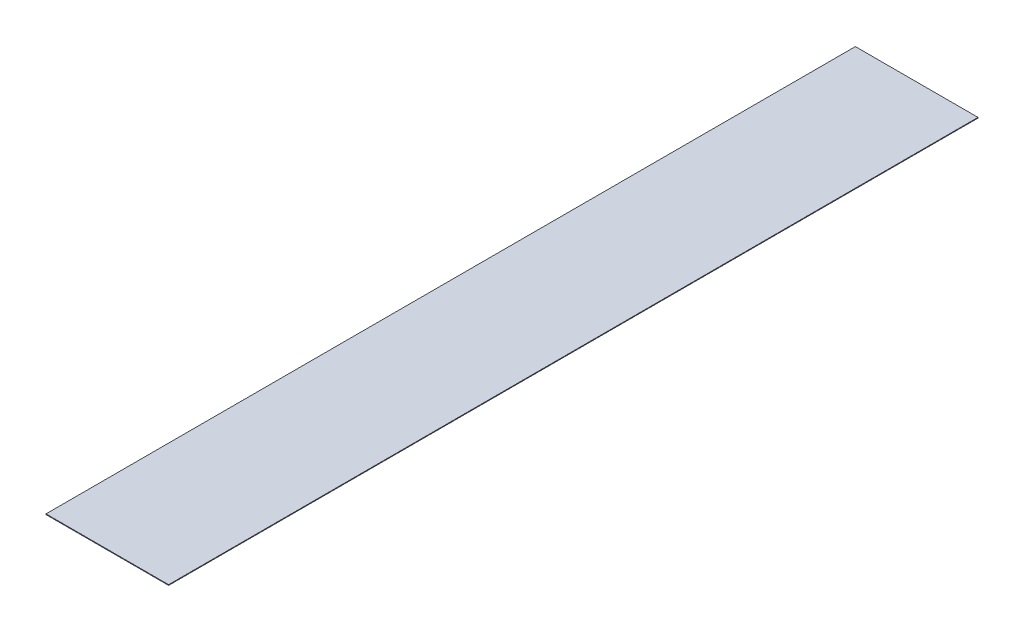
ISO-10303-21;
HEADER;
FILE_DESCRIPTION(('STEP AP214'),'2;1');
FILE_NAME('part.step','',(''),(''),'','','');
FILE_SCHEMA(('AUTOMOTIVE_DESIGN { 1 0 10303 214 1 1 1 1 }'));
ENDSEC;
DATA;
#1=APPLICATION_CONTEXT('core data for automotive mechanical design processes');
#2=APPLICATION_PROTOCOL_DEFINITION('international standard','automotive_design',2000,#1);
#3=PRODUCT_CONTEXT('',#1,'mechanical');
#4=PRODUCT('Part','Part','',(#3));
#5=PRODUCT_RELATED_PRODUCT_CATEGORY('part','',(#4));
#6=PRODUCT_DEFINITION_FORMATION('','',#4);
#7=PRODUCT_DEFINITION_CONTEXT('part definition',#1,'design');
#8=PRODUCT_DEFINITION('design','',#6,#7);
#9=PRODUCT_DEFINITION_SHAPE('','',#8);
#10=(LENGTH_UNIT() NAMED_UNIT(*) SI_UNIT(.MILLI.,.METRE.));
#11=(NAMED_UNIT(*) PLANE_ANGLE_UNIT() SI_UNIT($,.RADIAN.));
#12=(NAMED_UNIT(*) SI_UNIT($,.STERADIAN.) SOLID_ANGLE_UNIT());
#13=UNCERTAINTY_MEASURE_WITH_UNIT(LENGTH_MEASURE(1.E-05),#10,'distance_accuracy_value','');
#14=(GEOMETRIC_REPRESENTATION_CONTEXT(3) GLOBAL_UNCERTAINTY_ASSIGNED_CONTEXT((#13)) GLOBAL_UNIT_ASSIGNED_CONTEXT((#10,
#11,#12)) REPRESENTATION_CONTEXT('',''));
#15=CARTESIAN_POINT('',(0.,0.,0.));
#16=DIRECTION('',(0.,0.,1.));
#17=DIRECTION('',(1.,0.,0.));
#18=AXIS2_PLACEMENT_3D('',#15,#16,#17);
#19=CARTESIAN_POINT('',(0.,0.254,76.2));
#20=DIRECTION('',(0.,0.,-1.));
#21=DIRECTION('',(-1.,0.,0.));
#22=AXIS2_PLACEMENT_3D('',#19,#20,#21);
#23=PLANE('',#22);
#24=DIRECTION('',(1.,0.,0.));
#25=VECTOR('',#24,1.);
#26=CARTESIAN_POINT('',(0.,0.,76.2));
#27=LINE('',#26,#25);
#28=CARTESIAN_POINT('',(19.05,0.,76.2));
#29=VERTEX_POINT('',#28);
#30=CARTESIAN_POINT('',(66.675,0.,76.2));
#31=VERTEX_POINT('',#30);
#32=EDGE_CURVE('E98',#29,#31,#27,.T.);
#33=ORIENTED_EDGE('',*,*,#32,.T.);
#34=DIRECTION('',(0.,-1.,0.));
#35=VECTOR('',#34,1.);
#36=CARTESIAN_POINT('',(66.675,0.254,76.2));
#37=LINE('',#36,#35);
#38=CARTESIAN_POINT('',(66.675,0.254,76.2));
#39=VERTEX_POINT('',#38);
#40=EDGE_CURVE('E11',#39,#31,#37,.T.);
#41=ORIENTED_EDGE('',*,*,#40,.F.);
#42=DIRECTION('',(1.,0.,0.));
#43=VECTOR('',#42,1.);
#44=CARTESIAN_POINT('',(0.,0.254,76.2));
#45=LINE('',#44,#43);
#46=CARTESIAN_POINT('',(19.05,0.254,76.2));
#47=VERTEX_POINT('',#46);
#48=EDGE_CURVE('E84',#47,#39,#45,.T.);
#49=ORIENTED_EDGE('',*,*,#48,.F.);
#50=DIRECTION('',(0.,-1.,0.));
#51=VECTOR('',#50,1.);
#52=CARTESIAN_POINT('',(19.05,0.254,76.2));
#53=LINE('',#52,#51);
#54=EDGE_CURVE('E51',#47,#29,#53,.T.);
#55=ORIENTED_EDGE('',*,*,#54,.T.);
#56=EDGE_LOOP('',(#33,#41,#49,#55));
#57=FACE_BOUND('',#56,.T.);
#58=ADVANCED_FACE('F35',(#57),#23,.F.);
#59=CARTESIAN_POINT('',(66.675,0.254,0.));
#60=DIRECTION('',(-1.,0.,0.));
#61=DIRECTION('',(0.,0.,1.));
#62=AXIS2_PLACEMENT_3D('',#59,#60,#61);
#63=PLANE('',#62);
#64=DIRECTION('',(0.,0.,-1.));
#65=VECTOR('',#64,1.);
#66=CARTESIAN_POINT('',(66.675,0.,0.));
#67=LINE('',#66,#65);
#68=CARTESIAN_POINT('',(66.675,0.,-238.125));
#69=VERTEX_POINT('',#68);
#70=EDGE_CURVE('E89',#31,#69,#67,.T.);
#71=ORIENTED_EDGE('',*,*,#70,.T.);
#72=DIRECTION('',(0.,-1.,0.));
#73=VECTOR('',#72,1.);
#74=CARTESIAN_POINT('',(66.675,0.254,-238.125));
#75=LINE('',#74,#73);
#76=CARTESIAN_POINT('',(66.675,0.254,-238.125));
#77=VERTEX_POINT('',#76);
#78=EDGE_CURVE('E43',#77,#69,#75,.T.);
#79=ORIENTED_EDGE('',*,*,#78,.F.);
#80=DIRECTION('',(0.,0.,-1.));
#81=VECTOR('',#80,1.);
#82=CARTESIAN_POINT('',(66.675,0.254,0.));
#83=LINE('',#82,#81);
#84=EDGE_CURVE('E76',#39,#77,#83,.T.);
#85=ORIENTED_EDGE('',*,*,#84,.F.);
#86=ORIENTED_EDGE('',*,*,#40,.T.);
#87=EDGE_LOOP('',(#71,#79,#85,#86));
#88=FACE_BOUND('',#87,.T.);
#89=ADVANCED_FACE('F88',(#88),#63,.F.);
#90=CARTESIAN_POINT('',(0.,0.254,-238.125));
#91=DIRECTION('',(0.,0.,-1.));
#92=DIRECTION('',(-1.,0.,0.));
#93=AXIS2_PLACEMENT_3D('',#90,#91,#92);
#94=PLANE('',#93);
#95=DIRECTION('',(1.,0.,0.));
#96=VECTOR('',#95,1.);
#97=CARTESIAN_POINT('',(0.,0.,-238.125));
#98=LINE('',#97,#96);
#99=CARTESIAN_POINT('',(19.05,0.,-238.125));
#100=VERTEX_POINT('',#99);
#101=EDGE_CURVE('E101',#100,#69,#98,.T.);
#102=ORIENTED_EDGE('',*,*,#101,.F.);
#103=DIRECTION('',(0.,-1.,0.));
#104=VECTOR('',#103,1.);
#105=CARTESIAN_POINT('',(19.05,0.254,-238.125));
#106=LINE('',#105,#104);
#107=CARTESIAN_POINT('',(19.05,0.254,-238.125));
#108=VERTEX_POINT('',#107);
#109=EDGE_CURVE('E65',#108,#100,#106,.T.);
#110=ORIENTED_EDGE('',*,*,#109,.F.);
#111=DIRECTION('',(1.,0.,0.));
#112=VECTOR('',#111,1.);
#113=CARTESIAN_POINT('',(0.,0.254,-238.125));
#114=LINE('',#113,#112);
#115=EDGE_CURVE('E83',#108,#77,#114,.T.);
#116=ORIENTED_EDGE('',*,*,#115,.T.);
#117=ORIENTED_EDGE('',*,*,#78,.T.);
#118=EDGE_LOOP('',(#102,#110,#116,#117));
#119=FACE_BOUND('',#118,.T.);
#120=ADVANCED_FACE('F92',(#119),#94,.T.);
#121=CARTESIAN_POINT('',(19.05,0.254,0.));
#122=DIRECTION('',(-1.,0.,0.));
#123=DIRECTION('',(0.,0.,1.));
#124=AXIS2_PLACEMENT_3D('',#121,#122,#123);
#125=PLANE('',#124);
#126=DIRECTION('',(0.,0.,-1.));
#127=VECTOR('',#126,1.);
#128=CARTESIAN_POINT('',(19.05,0.,0.));
#129=LINE('',#128,#127);
#130=EDGE_CURVE('E103',#29,#100,#129,.T.);
#131=ORIENTED_EDGE('',*,*,#130,.F.);
#132=ORIENTED_EDGE('',*,*,#54,.F.);
#133=DIRECTION('',(0.,0.,-1.));
#134=VECTOR('',#133,1.);
#135=CARTESIAN_POINT('',(19.05,0.254,0.));
#136=LINE('',#135,#134);
#137=EDGE_CURVE('E93',#47,#108,#136,.T.);
#138=ORIENTED_EDGE('',*,*,#137,.T.);
#139=ORIENTED_EDGE('',*,*,#109,.T.);
#140=EDGE_LOOP('',(#131,#132,#138,#139));
#141=FACE_BOUND('',#140,.T.);
#142=ADVANCED_FACE('F109',(#141),#125,.T.);
#143=CARTESIAN_POINT('',(0.,0.254,0.));
#144=DIRECTION('',(0.,1.,0.));
#145=DIRECTION('',(0.,0.,1.));
#146=AXIS2_PLACEMENT_3D('',#143,#144,#145);
#147=PLANE('',#146);
#148=ORIENTED_EDGE('',*,*,#48,.T.);
#149=ORIENTED_EDGE('',*,*,#84,.T.);
#150=ORIENTED_EDGE('',*,*,#115,.F.);
#151=ORIENTED_EDGE('',*,*,#137,.F.);
#152=EDGE_LOOP('',(#148,#149,#150,#151));
#153=FACE_BOUND('',#152,.T.);
#154=ADVANCED_FACE('F80',(#153),#147,.T.);
#155=CARTESIAN_POINT('',(0.,0.,0.));
#156=DIRECTION('',(0.,1.,0.));
#157=DIRECTION('',(0.,0.,1.));
#158=AXIS2_PLACEMENT_3D('',#155,#156,#157);
#159=PLANE('',#158);
#160=ORIENTED_EDGE('',*,*,#32,.F.);
#161=ORIENTED_EDGE('',*,*,#130,.T.);
#162=ORIENTED_EDGE('',*,*,#101,.T.);
#163=ORIENTED_EDGE('',*,*,#70,.F.);
#164=EDGE_LOOP('',(#160,#161,#162,#163));
#165=FACE_BOUND('',#164,.T.);
#166=ADVANCED_FACE('F108',(#165),#159,.F.);
#167=CLOSED_SHELL('',(#58,#89,#120,#142,#154,#166));
#168=MANIFOLD_SOLID_BREP('B2',#167);
#169=ADVANCED_BREP_SHAPE_REPRESENTATION('',(#18,#168),#14);
#170=SHAPE_DEFINITION_REPRESENTATION(#9,#169);
ENDSEC;
END-ISO-10303-21;
